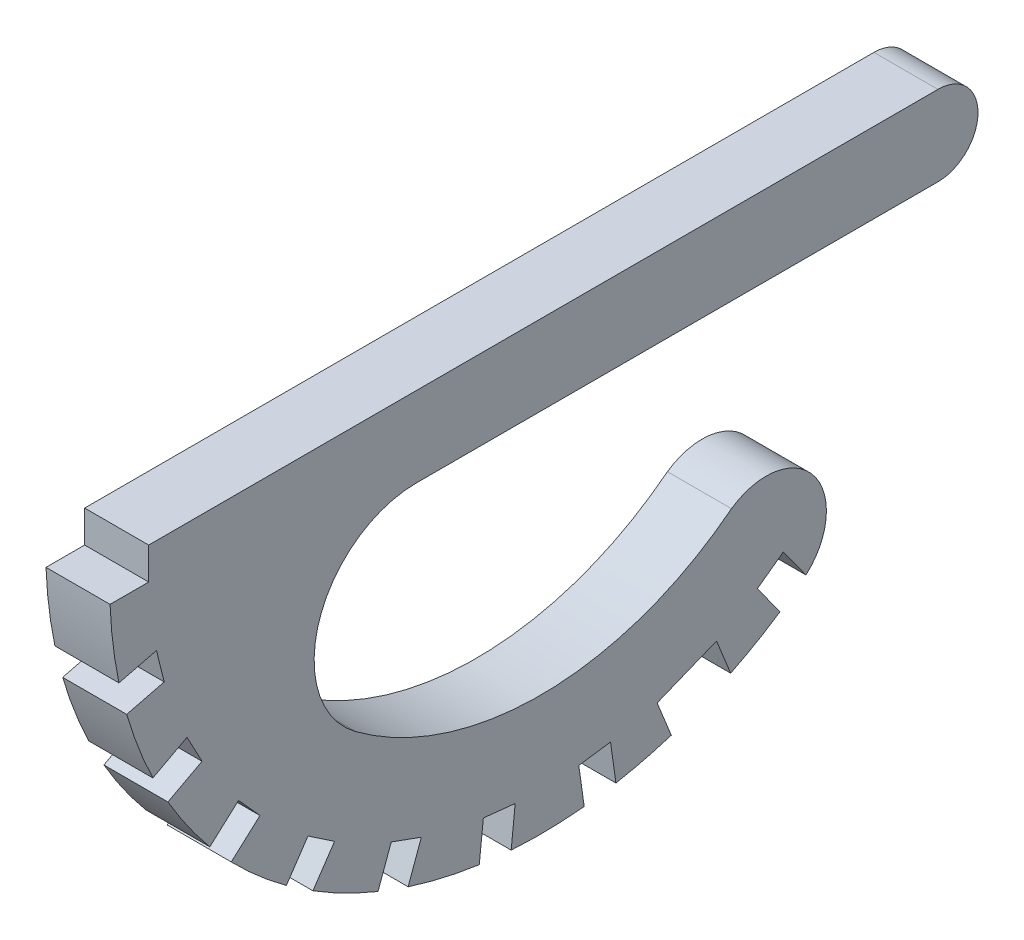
from build123d import *

# Parameters (mm, degrees)
EXTRUDE_START   = 300
EXTRUDE_1_DEPTH = 36


with BuildPart() as part:
    # Sketch 1 → Extrude 1 (new body)
    with BuildSketch(Plane(origin=(0, 0, 0), x_dir=(0, 0, -1), z_dir=(1, 0, 0)).offset(EXTRUDE_START)):
        with BuildLine():
            Line((-220, -9), (-241.713349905, -9))
            ThreePointArc((-241.713349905, -9), (-240.077902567, -29.477859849), (-236.710727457, -49.743090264))
            Line((-236.710727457, -49.743090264), (-215.642356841, -44.490155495))
            Line((-215.642356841, -44.490155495), (-211.28776272, -61.955478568))
            Line((-211.28776272, -61.955478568), (-232.356133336, -67.208413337))
            ThreePointArc((-232.356133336, -67.208413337), (-225.815223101, -86.682342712), (-217.645464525, -105.53101579))
            Line((-217.645464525, -105.53101579), (-198.473714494, -95.337215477))
            Line((-198.473714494, -95.337215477), (-190.023226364, -111.230272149))
            Line((-190.023226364, -111.230272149), (-209.194976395, -121.424072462))
            ThreePointArc((-209.194976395, -121.424072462), (-198.137189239, -138.737153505), (-185.650200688, -155.049496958))
            Line((-185.650200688, -155.049496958), (-169.514037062, -140.52042997))
            Line((-169.514037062, -140.52042997), (-157.469686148, -153.897036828))
            Line((-157.469686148, -153.897036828), (-173.605849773, -168.426103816))
            ThreePointArc((-173.605849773, -168.426103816), (-158.688112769, -182.549791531), (-142.625728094, -195.356712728))
            Line((-142.625728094, -195.356712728), (-130.483776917, -177.355529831))
            Line((-130.483776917, -177.355529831), (-115.561100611, -187.421002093))
            Line((-115.561100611, -187.421002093), (-127.703051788, -205.422184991))
            ThreePointArc((-127.703051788, -205.422184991), (-109.811606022, -215.517411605), (-91.128068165, -224.058069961))
            Line((-91.128068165, -224.058069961), (-83.701665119, -203.654195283))
            Line((-83.701665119, -203.654195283), (-66.787197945, -209.810557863))
            Line((-66.787197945, -209.810557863), (-74.213600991, -230.214432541))
            ThreePointArc((-74.213600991, -230.214432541), (-54.411351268, -235.681455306), (-34.216622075, -239.448462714))
            Line((-34.216622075, -239.448462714), (-31.946958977, -217.854060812))
            Line((-31.946958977, -217.854060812), (-14.045564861, -219.73557315))
            Line((-14.045564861, -219.73557315), (-16.315227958, -241.329975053))
            ThreePointArc((-16.315227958, -241.329975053), (4.221402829, -241.844006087), (24.727583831, -240.613570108))
            Line((24.727583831, -240.613570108), (21.705669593, -219.111533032))
            Line((21.705669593, -219.111533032), (39.53049483, -216.606417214))
            Line((39.53049483, -216.606417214), (42.552409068, -238.108454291))
            ThreePointArc((42.552409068, -238.108454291), (58.23904621, -234.764897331), (73.669608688, -230.389088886))
            Line((73.669608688, -230.389088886), (65.724141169, -210.723366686))
            Line((65.724141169, -210.723366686), (74.06879586, -207.351907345))
            Line((74.06879586, -207.351907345), (90.758105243, -200.608988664))
            Line((90.758105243, -200.608988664), (99.102759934, -197.237529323))
            Line((99.102759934, -197.237529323), (107.048227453, -216.903251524))
            ThreePointArc((107.048227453, -216.903251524), (121.187737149, -209.33197531), (134.794389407, -200.840275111))
            Line((134.794389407, -200.840275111), (122.031602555, -183.273806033))
            Line((122.031602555, -183.273806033), (136.593908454, -172.693671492))
            Line((136.593908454, -172.693671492), (149.353394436, -190.255597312))
            ThreePointArc((149.353394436, -190.255597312), (153.581867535, -143.860808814), (107.495101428, -137.051522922))
            ThreePointArc((107.495101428, -137.051522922), (2.36280268, -174.162952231), (-103.737571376, -139.917236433))
            ThreePointArc((-103.737571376, -139.917236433), (-124.135610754, -75.554024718), (-69.416490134, -36))
            Line((-69.416490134, -36), (223.530387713, -36))
            ThreePointArc((223.530387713, -36), (246.030387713, -13.5), (223.530387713, 9))
            Line((223.530387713, 9), (-220, 9))
            Line((-220, 9), (-220, -9))
        make_face()
    extrude(amount=EXTRUDE_1_DEPTH)


solid = part.part
